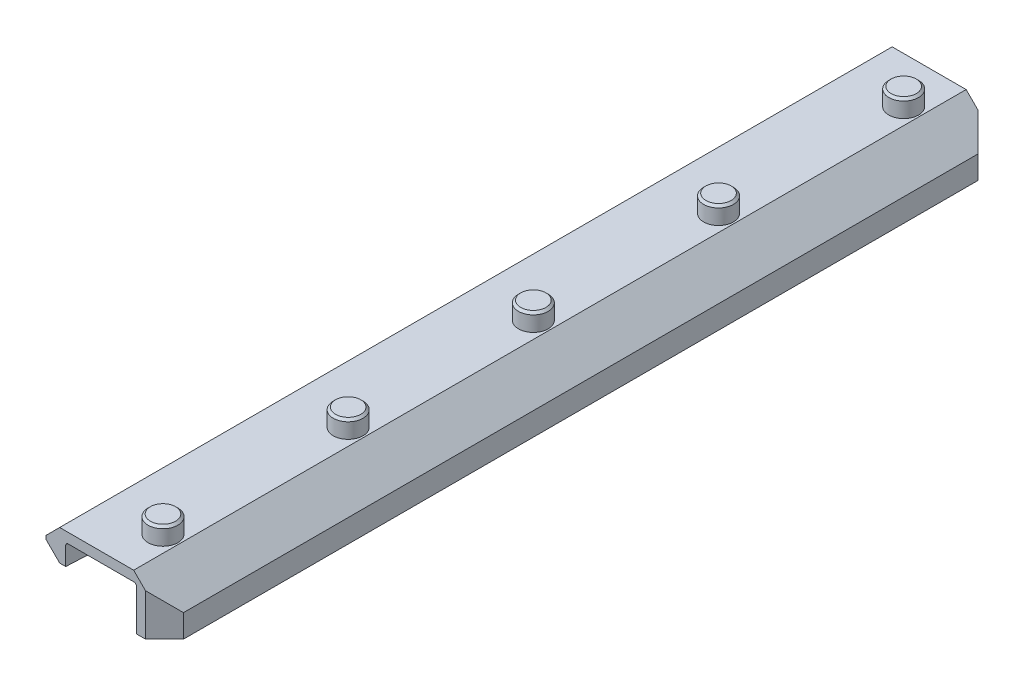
ISO-10303-21;
HEADER;
FILE_DESCRIPTION(('STEP AP214'),'2;1');
FILE_NAME('part.step','',(''),(''),'','','');
FILE_SCHEMA(('AUTOMOTIVE_DESIGN { 1 0 10303 214 1 1 1 1 }'));
ENDSEC;
DATA;
#1=APPLICATION_CONTEXT('core data for automotive mechanical design processes');
#2=APPLICATION_PROTOCOL_DEFINITION('international standard','automotive_design',2000,#1);
#3=PRODUCT_CONTEXT('',#1,'mechanical');
#4=PRODUCT('Part','Part','',(#3));
#5=PRODUCT_RELATED_PRODUCT_CATEGORY('part','',(#4));
#6=PRODUCT_DEFINITION_FORMATION('','',#4);
#7=PRODUCT_DEFINITION_CONTEXT('part definition',#1,'design');
#8=PRODUCT_DEFINITION('design','',#6,#7);
#9=PRODUCT_DEFINITION_SHAPE('','',#8);
#10=(LENGTH_UNIT() NAMED_UNIT(*) SI_UNIT(.MILLI.,.METRE.));
#11=(NAMED_UNIT(*) PLANE_ANGLE_UNIT() SI_UNIT($,.RADIAN.));
#12=(NAMED_UNIT(*) SI_UNIT($,.STERADIAN.) SOLID_ANGLE_UNIT());
#13=UNCERTAINTY_MEASURE_WITH_UNIT(LENGTH_MEASURE(1.E-05),#10,'distance_accuracy_value','');
#14=(GEOMETRIC_REPRESENTATION_CONTEXT(3) GLOBAL_UNCERTAINTY_ASSIGNED_CONTEXT((#13)) GLOBAL_UNIT_ASSIGNED_CONTEXT((#10,
#11,#12)) REPRESENTATION_CONTEXT('',''));
#15=CARTESIAN_POINT('',(0.,0.,0.));
#16=DIRECTION('',(0.,0.,1.));
#17=DIRECTION('',(1.,0.,0.));
#18=AXIS2_PLACEMENT_3D('',#15,#16,#17);
#19=CARTESIAN_POINT('',(-7.62,4.5,139.192));
#20=DIRECTION('',(0.,-1.,0.));
#21=DIRECTION('',(0.,0.,-1.));
#22=AXIS2_PLACEMENT_3D('',#19,#20,#21);
#23=PLANE('',#22);
#24=CARTESIAN_POINT('',(1.98119999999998,4.5,131.5212));
#25=DIRECTION('',(0.,-1.,0.));
#26=DIRECTION('',(0.,0.,-1.));
#27=AXIS2_PLACEMENT_3D('',#24,#25,#26);
#28=CIRCLE('',#27,2.4892);
#29=CARTESIAN_POINT('',(1.98119999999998,4.5,129.032));
#30=VERTEX_POINT('',#29);
#31=EDGE_CURVE('E260',#30,#30,#28,.F.);
#32=ORIENTED_EDGE('',*,*,#31,.F.);
#33=EDGE_LOOP('',(#32));
#34=FACE_BOUND('',#33,.T.);
#35=CARTESIAN_POINT('',(1.98119999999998,4.5,38.6334));
#36=DIRECTION('',(0.,-1.,0.));
#37=DIRECTION('',(0.,0.,-1.));
#38=AXIS2_PLACEMENT_3D('',#35,#36,#37);
#39=CIRCLE('',#38,2.4892);
#40=CARTESIAN_POINT('',(1.98119999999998,4.5,36.1442));
#41=VERTEX_POINT('',#40);
#42=EDGE_CURVE('E254',#41,#41,#39,.F.);
#43=ORIENTED_EDGE('',*,*,#42,.F.);
#44=EDGE_LOOP('',(#43));
#45=FACE_BOUND('',#44,.T.);
#46=DIRECTION('',(-1.,0.,0.));
#47=VECTOR('',#46,1.);
#48=CARTESIAN_POINT('',(-7.62,4.5,0.));
#49=LINE('',#48,#47);
#50=CARTESIAN_POINT('',(4.7498,4.5,0.));
#51=VERTEX_POINT('',#50);
#52=CARTESIAN_POINT('',(-7.62,4.5,0.));
#53=VERTEX_POINT('',#52);
#54=EDGE_CURVE('E371',#51,#53,#49,.T.);
#55=ORIENTED_EDGE('',*,*,#54,.T.);
#56=DIRECTION('',(0.,0.,-1.));
#57=VECTOR('',#56,1.);
#58=CARTESIAN_POINT('',(-7.62,4.5,139.192));
#59=LINE('',#58,#57);
#60=CARTESIAN_POINT('',(-7.62,4.5,139.192));
#61=VERTEX_POINT('',#60);
#62=EDGE_CURVE('E194',#61,#53,#59,.T.);
#63=ORIENTED_EDGE('',*,*,#62,.F.);
#64=DIRECTION('',(-1.,0.,0.));
#65=VECTOR('',#64,1.);
#66=CARTESIAN_POINT('',(-7.62,4.5,139.192));
#67=LINE('',#66,#65);
#68=CARTESIAN_POINT('',(4.7498,4.5,139.192));
#69=VERTEX_POINT('',#68);
#70=EDGE_CURVE('E181',#69,#61,#67,.T.);
#71=ORIENTED_EDGE('',*,*,#70,.F.);
#72=DIRECTION('',(0.,0.,-1.));
#73=VECTOR('',#72,1.);
#74=CARTESIAN_POINT('',(4.7498,4.5,139.192));
#75=LINE('',#74,#73);
#76=EDGE_CURVE('E192',#69,#51,#75,.T.);
#77=ORIENTED_EDGE('',*,*,#76,.T.);
#78=EDGE_LOOP('',(#55,#63,#71,#77));
#79=FACE_BOUND('',#78,.T.);
#80=CARTESIAN_POINT('',(1.98119999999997,4.5,7.67079999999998));
#81=DIRECTION('',(0.,-1.,0.));
#82=DIRECTION('',(0.,0.,-1.));
#83=AXIS2_PLACEMENT_3D('',#80,#81,#82);
#84=CIRCLE('',#83,2.4892);
#85=CARTESIAN_POINT('',(1.98119999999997,4.5,5.18159999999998));
#86=VERTEX_POINT('',#85);
#87=EDGE_CURVE('E251',#86,#86,#84,.F.);
#88=ORIENTED_EDGE('',*,*,#87,.F.);
#89=EDGE_LOOP('',(#88));
#90=FACE_BOUND('',#89,.T.);
#91=CARTESIAN_POINT('',(1.98119999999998,4.5,100.5586));
#92=DIRECTION('',(0.,-1.,0.));
#93=DIRECTION('',(0.,0.,-1.));
#94=AXIS2_PLACEMENT_3D('',#91,#92,#93);
#95=CIRCLE('',#94,2.48919999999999);
#96=CARTESIAN_POINT('',(1.98119999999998,4.5,98.0694));
#97=VERTEX_POINT('',#96);
#98=EDGE_CURVE('E257',#97,#97,#95,.F.);
#99=ORIENTED_EDGE('',*,*,#98,.F.);
#100=EDGE_LOOP('',(#99));
#101=FACE_BOUND('',#100,.T.);
#102=CARTESIAN_POINT('',(1.98119999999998,4.5,69.596));
#103=DIRECTION('',(0.,-1.,0.));
#104=DIRECTION('',(0.,0.,-1.));
#105=AXIS2_PLACEMENT_3D('',#102,#103,#104);
#106=CIRCLE('',#105,2.4892);
#107=CARTESIAN_POINT('',(1.98119999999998,4.5,67.1068));
#108=VERTEX_POINT('',#107);
#109=EDGE_CURVE('E263',#108,#108,#106,.F.);
#110=ORIENTED_EDGE('',*,*,#109,.F.);
#111=EDGE_LOOP('',(#110));
#112=FACE_BOUND('',#111,.T.);
#113=ADVANCED_FACE('F33',(#34,#45,#79,#90,#101,#112),#23,.F.);
#114=CARTESIAN_POINT('',(4.7498,4.5,139.192));
#115=DIRECTION('',(-0.707106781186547,-0.707106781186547,0.));
#116=DIRECTION('',(0.707106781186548,-0.707106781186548,0.));
#117=AXIS2_PLACEMENT_3D('',#114,#115,#116);
#118=PLANE('',#117);
#119=DIRECTION('',(0.,0.,-1.));
#120=VECTOR('',#119,1.);
#121=CARTESIAN_POINT('',(9.906,-0.656200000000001,139.192));
#122=LINE('',#121,#120);
#123=CARTESIAN_POINT('',(9.906,-0.656200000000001,136.017));
#124=VERTEX_POINT('',#123);
#125=CARTESIAN_POINT('',(9.906,-0.656199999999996,3.17499999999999));
#126=VERTEX_POINT('',#125);
#127=EDGE_CURVE('E369',#124,#126,#122,.T.);
#128=ORIENTED_EDGE('',*,*,#127,.T.);
#129=DIRECTION('',(0.577350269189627,-0.577350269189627,0.577350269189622));
#130=VECTOR('',#129,1.);
#131=CARTESIAN_POINT('',(9.906,-0.656200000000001,3.17500000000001));
#132=LINE('',#131,#130);
#133=CARTESIAN_POINT('',(6.73099999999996,2.51880000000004,0.));
#134=VERTEX_POINT('',#133);
#135=EDGE_CURVE('E242',#126,#134,#132,.F.);
#136=ORIENTED_EDGE('',*,*,#135,.T.);
#137=DIRECTION('',(-0.707106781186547,0.707106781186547,0.));
#138=VECTOR('',#137,1.);
#139=CARTESIAN_POINT('',(4.7498,4.5,0.));
#140=LINE('',#139,#138);
#141=EDGE_CURVE('E201',#134,#51,#140,.T.);
#142=ORIENTED_EDGE('',*,*,#141,.T.);
#143=ORIENTED_EDGE('',*,*,#76,.F.);
#144=DIRECTION('',(-0.707106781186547,0.707106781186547,0.));
#145=VECTOR('',#144,1.);
#146=CARTESIAN_POINT('',(4.7498,4.5,139.192));
#147=LINE('',#146,#145);
#148=CARTESIAN_POINT('',(6.73099999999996,2.51880000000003,139.192));
#149=VERTEX_POINT('',#148);
#150=EDGE_CURVE('E177',#149,#69,#147,.T.);
#151=ORIENTED_EDGE('',*,*,#150,.F.);
#152=DIRECTION('',(0.577350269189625,-0.577350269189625,-0.577350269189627));
#153=VECTOR('',#152,1.);
#154=CARTESIAN_POINT('',(4.00896666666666,5.24083333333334,141.914033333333));
#155=LINE('',#154,#153);
#156=EDGE_CURVE('E240',#149,#124,#155,.T.);
#157=ORIENTED_EDGE('',*,*,#156,.T.);
#158=EDGE_LOOP('',(#128,#136,#142,#143,#151,#157));
#159=FACE_BOUND('',#158,.T.);
#160=ADVANCED_FACE('F199',(#159),#118,.F.);
#161=CARTESIAN_POINT('',(-9.906,2.214,139.192));
#162=DIRECTION('',(0.707106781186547,-0.707106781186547,0.));
#163=DIRECTION('',(0.707106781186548,0.707106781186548,0.));
#164=AXIS2_PLACEMENT_3D('',#161,#162,#163);
#165=PLANE('',#164);
#166=DIRECTION('',(-0.707106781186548,-0.707106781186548,0.));
#167=VECTOR('',#166,1.);
#168=CARTESIAN_POINT('',(-9.906,2.214,0.));
#169=LINE('',#168,#167);
#170=CARTESIAN_POINT('',(-9.906,2.214,0.));
#171=VERTEX_POINT('',#170);
#172=EDGE_CURVE('E373',#53,#171,#169,.T.);
#173=ORIENTED_EDGE('',*,*,#172,.T.);
#174=DIRECTION('',(0.,0.,-1.));
#175=VECTOR('',#174,1.);
#176=CARTESIAN_POINT('',(-9.906,2.214,139.192));
#177=LINE('',#176,#175);
#178=CARTESIAN_POINT('',(-9.906,2.214,139.192));
#179=VERTEX_POINT('',#178);
#180=EDGE_CURVE('E208',#179,#171,#177,.T.);
#181=ORIENTED_EDGE('',*,*,#180,.F.);
#182=DIRECTION('',(-0.707106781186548,-0.707106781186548,0.));
#183=VECTOR('',#182,1.);
#184=CARTESIAN_POINT('',(-9.906,2.214,139.192));
#185=LINE('',#184,#183);
#186=EDGE_CURVE('E196',#61,#179,#185,.T.);
#187=ORIENTED_EDGE('',*,*,#186,.F.);
#188=ORIENTED_EDGE('',*,*,#62,.T.);
#189=EDGE_LOOP('',(#173,#181,#187,#188));
#190=FACE_BOUND('',#189,.T.);
#191=ADVANCED_FACE('F442',(#190),#165,.F.);
#192=CARTESIAN_POINT('',(-9.906,1.6298,139.192));
#193=DIRECTION('',(1.,0.,0.));
#194=DIRECTION('',(0.,0.,-1.));
#195=AXIS2_PLACEMENT_3D('',#192,#193,#194);
#196=PLANE('',#195);
#197=DIRECTION('',(0.,-1.,0.));
#198=VECTOR('',#197,1.);
#199=CARTESIAN_POINT('',(-9.906,1.6298,0.));
#200=LINE('',#199,#198);
#201=CARTESIAN_POINT('',(-9.906,1.6298,0.));
#202=VERTEX_POINT('',#201);
#203=EDGE_CURVE('E375',#171,#202,#200,.T.);
#204=ORIENTED_EDGE('',*,*,#203,.T.);
#205=DIRECTION('',(0.,0.,-1.));
#206=VECTOR('',#205,1.);
#207=CARTESIAN_POINT('',(-9.906,1.6298,139.192));
#208=LINE('',#207,#206);
#209=CARTESIAN_POINT('',(-9.906,1.6298,139.192));
#210=VERTEX_POINT('',#209);
#211=EDGE_CURVE('E399',#210,#202,#208,.T.);
#212=ORIENTED_EDGE('',*,*,#211,.F.);
#213=DIRECTION('',(0.,-1.,0.));
#214=VECTOR('',#213,1.);
#215=CARTESIAN_POINT('',(-9.906,1.6298,139.192));
#216=LINE('',#215,#214);
#217=EDGE_CURVE('E364',#179,#210,#216,.T.);
#218=ORIENTED_EDGE('',*,*,#217,.F.);
#219=ORIENTED_EDGE('',*,*,#180,.T.);
#220=EDGE_LOOP('',(#204,#212,#218,#219));
#221=FACE_BOUND('',#220,.T.);
#222=ADVANCED_FACE('F406',(#221),#196,.F.);
#223=CARTESIAN_POINT('',(-7.62,-0.656200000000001,139.192));
#224=DIRECTION('',(0.707106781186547,0.707106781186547,0.));
#225=DIRECTION('',(-0.707106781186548,0.707106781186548,0.));
#226=AXIS2_PLACEMENT_3D('',#223,#224,#225);
#227=PLANE('',#226);
#228=DIRECTION('',(0.707106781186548,-0.707106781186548,0.));
#229=VECTOR('',#228,1.);
#230=CARTESIAN_POINT('',(-7.62,-0.656200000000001,0.));
#231=LINE('',#230,#229);
#232=CARTESIAN_POINT('',(-7.62,-0.656200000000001,0.));
#233=VERTEX_POINT('',#232);
#234=EDGE_CURVE('E377',#202,#233,#231,.T.);
#235=ORIENTED_EDGE('',*,*,#234,.T.);
#236=DIRECTION('',(0.,0.,-1.));
#237=VECTOR('',#236,1.);
#238=CARTESIAN_POINT('',(-7.62,-0.656200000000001,139.192));
#239=LINE('',#238,#237);
#240=CARTESIAN_POINT('',(-7.62,-0.656200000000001,139.192));
#241=VERTEX_POINT('',#240);
#242=EDGE_CURVE('E397',#241,#233,#239,.T.);
#243=ORIENTED_EDGE('',*,*,#242,.F.);
#244=DIRECTION('',(0.707106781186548,-0.707106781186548,0.));
#245=VECTOR('',#244,1.);
#246=CARTESIAN_POINT('',(-7.62,-0.656200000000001,139.192));
#247=LINE('',#246,#245);
#248=EDGE_CURVE('E356',#210,#241,#247,.T.);
#249=ORIENTED_EDGE('',*,*,#248,.F.);
#250=ORIENTED_EDGE('',*,*,#211,.T.);
#251=EDGE_LOOP('',(#235,#243,#249,#250));
#252=FACE_BOUND('',#251,.T.);
#253=ADVANCED_FACE('F415',(#252),#227,.F.);
#254=CARTESIAN_POINT('',(-6.096,-0.656200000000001,139.192));
#255=DIRECTION('',(0.,1.,0.));
#256=DIRECTION('',(-1.,0.,0.));
#257=AXIS2_PLACEMENT_3D('',#254,#255,#256);
#258=PLANE('',#257);
#259=DIRECTION('',(1.,0.,0.));
#260=VECTOR('',#259,1.);
#261=CARTESIAN_POINT('',(-6.096,-0.656200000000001,0.));
#262=LINE('',#261,#260);
#263=CARTESIAN_POINT('',(-6.604,-0.656200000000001,0.));
#264=VERTEX_POINT('',#263);
#265=EDGE_CURVE('E379',#233,#264,#262,.T.);
#266=ORIENTED_EDGE('',*,*,#265,.T.);
#267=DIRECTION('',(-0.0457187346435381,0.,-0.998954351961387));
#268=VECTOR('',#267,1.);
#269=CARTESIAN_POINT('',(-6.096,-0.656200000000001,11.0998000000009));
#270=LINE('',#269,#268);
#271=CARTESIAN_POINT('',(-6.09600000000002,-0.656200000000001,11.0998));
#272=VERTEX_POINT('',#271);
#273=EDGE_CURVE('E233',#264,#272,#270,.F.);
#274=ORIENTED_EDGE('',*,*,#273,.T.);
#275=DIRECTION('',(0.,0.,-1.));
#276=VECTOR('',#275,1.);
#277=CARTESIAN_POINT('',(-6.096,-0.656200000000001,139.192));
#278=LINE('',#277,#276);
#279=CARTESIAN_POINT('',(-6.096,-0.656200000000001,128.092199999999));
#280=VERTEX_POINT('',#279);
#281=EDGE_CURVE('E394',#280,#272,#278,.T.);
#282=ORIENTED_EDGE('',*,*,#281,.F.);
#283=DIRECTION('',(-0.0457187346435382,0.,0.998954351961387));
#284=VECTOR('',#283,1.);
#285=CARTESIAN_POINT('',(-6.604,-0.656200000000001,139.192));
#286=LINE('',#285,#284);
#287=CARTESIAN_POINT('',(-6.604,-0.656200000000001,139.192));
#288=VERTEX_POINT('',#287);
#289=EDGE_CURVE('E219',#280,#288,#286,.T.);
#290=ORIENTED_EDGE('',*,*,#289,.T.);
#291=DIRECTION('',(1.,0.,0.));
#292=VECTOR('',#291,1.);
#293=CARTESIAN_POINT('',(-6.096,-0.656200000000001,139.192));
#294=LINE('',#293,#292);
#295=EDGE_CURVE('E354',#241,#288,#294,.T.);
#296=ORIENTED_EDGE('',*,*,#295,.F.);
#297=ORIENTED_EDGE('',*,*,#242,.T.);
#298=EDGE_LOOP('',(#266,#274,#282,#290,#296,#297));
#299=FACE_BOUND('',#298,.T.);
#300=ADVANCED_FACE('F416',(#299),#258,.F.);
#301=CARTESIAN_POINT('',(-6.096,2.8236,139.192));
#302=DIRECTION('',(-1.,0.,0.));
#303=DIRECTION('',(0.,-1.,0.));
#304=AXIS2_PLACEMENT_3D('',#301,#302,#303);
#305=PLANE('',#304);
#306=DIRECTION('',(0.,1.,0.));
#307=VECTOR('',#306,1.);
#308=CARTESIAN_POINT('',(-6.096,2.8236,11.0998000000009));
#309=LINE('',#308,#307);
#310=CARTESIAN_POINT('',(-6.096,2.4426,11.0998000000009));
#311=VERTEX_POINT('',#310);
#312=EDGE_CURVE('E230',#272,#311,#309,.T.);
#313=ORIENTED_EDGE('',*,*,#312,.T.);
#314=DIRECTION('',(0.,0.,-1.));
#315=VECTOR('',#314,1.);
#316=CARTESIAN_POINT('',(-6.096,2.4426,128.092199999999));
#317=LINE('',#316,#315);
#318=CARTESIAN_POINT('',(-6.096,2.4426,128.092199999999));
#319=VERTEX_POINT('',#318);
#320=EDGE_CURVE('E319',#311,#319,#317,.F.);
#321=ORIENTED_EDGE('',*,*,#320,.T.);
#322=DIRECTION('',(0.,-1.,0.));
#323=VECTOR('',#322,1.);
#324=CARTESIAN_POINT('',(-6.096,-0.656200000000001,128.092199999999));
#325=LINE('',#324,#323);
#326=EDGE_CURVE('E217',#319,#280,#325,.T.);
#327=ORIENTED_EDGE('',*,*,#326,.T.);
#328=ORIENTED_EDGE('',*,*,#281,.T.);
#329=EDGE_LOOP('',(#313,#321,#327,#328));
#330=FACE_BOUND('',#329,.T.);
#331=ADVANCED_FACE('F424',(#330),#305,.F.);
#332=CARTESIAN_POINT('',(4.699,2.8236,139.192));
#333=DIRECTION('',(0.,1.,0.));
#334=DIRECTION('',(-1.,0.,0.));
#335=AXIS2_PLACEMENT_3D('',#332,#333,#334);
#336=PLANE('',#335);
#337=DIRECTION('',(1.,0.,0.));
#338=VECTOR('',#337,1.);
#339=CARTESIAN_POINT('',(4.699,2.8236,0.));
#340=LINE('',#339,#338);
#341=CARTESIAN_POINT('',(-6.22260119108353,2.8236,0.));
#342=VERTEX_POINT('',#341);
#343=CARTESIAN_POINT('',(4.82560119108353,2.8236,0.));
#344=VERTEX_POINT('',#343);
#345=EDGE_CURVE('E382',#342,#344,#340,.T.);
#346=ORIENTED_EDGE('',*,*,#345,.T.);
#347=DIRECTION('',(0.0457187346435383,0.,-0.998954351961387));
#348=VECTOR('',#347,1.);
#349=CARTESIAN_POINT('',(-1.53169137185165,2.8236,138.906842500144));
#350=LINE('',#349,#348);
#351=CARTESIAN_POINT('',(4.318,2.8236,11.0910860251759));
#352=VERTEX_POINT('',#351);
#353=EDGE_CURVE('E307',#344,#352,#350,.F.);
#354=ORIENTED_EDGE('',*,*,#353,.T.);
#355=DIRECTION('',(0.,0.,-1.));
#356=VECTOR('',#355,1.);
#357=CARTESIAN_POINT('',(4.318,2.8236,128.092199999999));
#358=LINE('',#357,#356);
#359=CARTESIAN_POINT('',(4.318,2.8236,128.100913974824));
#360=VERTEX_POINT('',#359);
#361=EDGE_CURVE('E303',#352,#360,#358,.F.);
#362=ORIENTED_EDGE('',*,*,#361,.T.);
#363=DIRECTION('',(0.0457187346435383,0.,0.998954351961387));
#364=VECTOR('',#363,1.);
#365=CARTESIAN_POINT('',(4.82533656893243,2.8236,139.186218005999));
#366=LINE('',#365,#364);
#367=CARTESIAN_POINT('',(4.82560119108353,2.8236,139.192));
#368=VERTEX_POINT('',#367);
#369=EDGE_CURVE('E305',#360,#368,#366,.T.);
#370=ORIENTED_EDGE('',*,*,#369,.T.);
#371=DIRECTION('',(1.,0.,0.));
#372=VECTOR('',#371,1.);
#373=CARTESIAN_POINT('',(4.699,2.8236,139.192));
#374=LINE('',#373,#372);
#375=CARTESIAN_POINT('',(-6.22260119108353,2.8236,139.192));
#376=VERTEX_POINT('',#375);
#377=EDGE_CURVE('E360',#376,#368,#374,.T.);
#378=ORIENTED_EDGE('',*,*,#377,.F.);
#379=DIRECTION('',(0.0457187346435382,0.,-0.998954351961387));
#380=VECTOR('',#379,1.);
#381=CARTESIAN_POINT('',(-6.19977283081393,2.8236,138.693200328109));
#382=LINE('',#381,#380);
#383=CARTESIAN_POINT('',(-5.715,2.8236,128.100913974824));
#384=VERTEX_POINT('',#383);
#385=EDGE_CURVE('E298',#376,#384,#382,.T.);
#386=ORIENTED_EDGE('',*,*,#385,.T.);
#387=DIRECTION('',(0.,0.,-1.));
#388=VECTOR('',#387,1.);
#389=CARTESIAN_POINT('',(-5.715,2.8236,11.0998000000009));
#390=LINE('',#389,#388);
#391=CARTESIAN_POINT('',(-5.715,2.8236,11.0910860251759));
#392=VERTEX_POINT('',#391);
#393=EDGE_CURVE('E296',#384,#392,#390,.T.);
#394=ORIENTED_EDGE('',*,*,#393,.T.);
#395=DIRECTION('',(0.0457187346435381,0.,0.998954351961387));
#396=VECTOR('',#395,1.);
#397=CARTESIAN_POINT('',(0.15725510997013,2.8236,139.399860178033));
#398=LINE('',#397,#396);
#399=EDGE_CURVE('E300',#392,#342,#398,.F.);
#400=ORIENTED_EDGE('',*,*,#399,.T.);
#401=EDGE_LOOP('',(#346,#354,#362,#370,#378,#386,#394,#400));
#402=FACE_BOUND('',#401,.T.);
#403=ADVANCED_FACE('F426',(#402),#336,.F.);
#404=CARTESIAN_POINT('',(4.699,-4.5,139.192));
#405=DIRECTION('',(1.,0.,0.));
#406=DIRECTION('',(0.,1.,0.));
#407=AXIS2_PLACEMENT_3D('',#404,#405,#406);
#408=PLANE('',#407);
#409=DIRECTION('',(0.,1.,0.));
#410=VECTOR('',#409,1.);
#411=CARTESIAN_POINT('',(4.699,2.8236,128.092199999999));
#412=LINE('',#411,#410);
#413=CARTESIAN_POINT('',(4.699,-4.5,128.092199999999));
#414=VERTEX_POINT('',#413);
#415=CARTESIAN_POINT('',(4.699,2.4426,128.092199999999));
#416=VERTEX_POINT('',#415);
#417=EDGE_CURVE('E215',#414,#416,#412,.T.);
#418=ORIENTED_EDGE('',*,*,#417,.T.);
#419=DIRECTION('',(0.,0.,-1.));
#420=VECTOR('',#419,1.);
#421=CARTESIAN_POINT('',(4.699,2.4426,11.0998000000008));
#422=LINE('',#421,#420);
#423=CARTESIAN_POINT('',(4.699,2.4426,11.0998000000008));
#424=VERTEX_POINT('',#423);
#425=EDGE_CURVE('E317',#416,#424,#422,.T.);
#426=ORIENTED_EDGE('',*,*,#425,.T.);
#427=DIRECTION('',(0.,-1.,0.));
#428=VECTOR('',#427,1.);
#429=CARTESIAN_POINT('',(4.699,-4.5,11.0998000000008));
#430=LINE('',#429,#428);
#431=CARTESIAN_POINT('',(4.69899999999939,-4.5,11.0998000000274));
#432=VERTEX_POINT('',#431);
#433=EDGE_CURVE('E221',#424,#432,#430,.T.);
#434=ORIENTED_EDGE('',*,*,#433,.T.);
#435=DIRECTION('',(0.,0.,-1.));
#436=VECTOR('',#435,1.);
#437=CARTESIAN_POINT('',(4.699,-4.5,139.192));
#438=LINE('',#437,#436);
#439=EDGE_CURVE('E391',#414,#432,#438,.T.);
#440=ORIENTED_EDGE('',*,*,#439,.F.);
#441=EDGE_LOOP('',(#418,#426,#434,#440));
#442=FACE_BOUND('',#441,.T.);
#443=ADVANCED_FACE('F432',(#442),#408,.F.);
#444=CARTESIAN_POINT('',(9.906,-4.5,139.192));
#445=DIRECTION('',(0.,1.,0.));
#446=DIRECTION('',(0.,0.,1.));
#447=AXIS2_PLACEMENT_3D('',#444,#445,#446);
#448=PLANE('',#447);
#449=DIRECTION('',(1.,0.,0.));
#450=VECTOR('',#449,1.);
#451=CARTESIAN_POINT('',(9.906,-4.5,0.));
#452=LINE('',#451,#450);
#453=CARTESIAN_POINT('',(5.207,-4.5,0.));
#454=VERTEX_POINT('',#453);
#455=CARTESIAN_POINT('',(6.73099999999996,-4.5,0.));
#456=VERTEX_POINT('',#455);
#457=EDGE_CURVE('E187',#454,#456,#452,.T.);
#458=ORIENTED_EDGE('',*,*,#457,.T.);
#459=DIRECTION('',(-0.707106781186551,0.,-0.707106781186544));
#460=VECTOR('',#459,1.);
#461=CARTESIAN_POINT('',(9.906,-4.5,3.17500000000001));
#462=LINE('',#461,#460);
#463=CARTESIAN_POINT('',(9.906,-4.5,3.17500000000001));
#464=VERTEX_POINT('',#463);
#465=EDGE_CURVE('E248',#456,#464,#462,.F.);
#466=ORIENTED_EDGE('',*,*,#465,.T.);
#467=DIRECTION('',(0.,0.,-1.));
#468=VECTOR('',#467,1.);
#469=CARTESIAN_POINT('',(9.906,-4.5,139.192));
#470=LINE('',#469,#468);
#471=CARTESIAN_POINT('',(9.906,-4.5,136.017));
#472=VERTEX_POINT('',#471);
#473=EDGE_CURVE('E388',#472,#464,#470,.T.);
#474=ORIENTED_EDGE('',*,*,#473,.F.);
#475=DIRECTION('',(-0.707106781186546,0.,0.707106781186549));
#476=VECTOR('',#475,1.);
#477=CARTESIAN_POINT('',(6.73099999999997,-4.5,139.192));
#478=LINE('',#477,#476);
#479=CARTESIAN_POINT('',(6.73099999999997,-4.5,139.192));
#480=VERTEX_POINT('',#479);
#481=EDGE_CURVE('E246',#472,#480,#478,.T.);
#482=ORIENTED_EDGE('',*,*,#481,.T.);
#483=DIRECTION('',(1.,0.,0.));
#484=VECTOR('',#483,1.);
#485=CARTESIAN_POINT('',(9.906,-4.5,139.192));
#486=LINE('',#485,#484);
#487=CARTESIAN_POINT('',(5.207,-4.5,139.192));
#488=VERTEX_POINT('',#487);
#489=EDGE_CURVE('E362',#488,#480,#486,.T.);
#490=ORIENTED_EDGE('',*,*,#489,.F.);
#491=DIRECTION('',(-0.0457187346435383,0.,-0.998954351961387));
#492=VECTOR('',#491,1.);
#493=CARTESIAN_POINT('',(5.207,-4.5,139.192));
#494=LINE('',#493,#492);
#495=EDGE_CURVE('E213',#488,#414,#494,.T.);
#496=ORIENTED_EDGE('',*,*,#495,.T.);
#497=ORIENTED_EDGE('',*,*,#439,.T.);
#498=DIRECTION('',(-0.0457187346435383,0.,0.998954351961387));
#499=VECTOR('',#498,1.);
#500=CARTESIAN_POINT('',(4.699,-4.5,11.0998000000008));
#501=LINE('',#500,#499);
#502=EDGE_CURVE('E223',#432,#454,#501,.F.);
#503=ORIENTED_EDGE('',*,*,#502,.T.);
#504=EDGE_LOOP('',(#458,#466,#474,#482,#490,#496,#497,#503));
#505=FACE_BOUND('',#504,.T.);
#506=ADVANCED_FACE('F664',(#505),#448,.F.);
#507=CARTESIAN_POINT('',(9.906,-0.656200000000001,139.192));
#508=DIRECTION('',(-1.,0.,0.));
#509=DIRECTION('',(0.,0.,1.));
#510=AXIS2_PLACEMENT_3D('',#507,#508,#509);
#511=PLANE('',#510);
#512=ORIENTED_EDGE('',*,*,#473,.T.);
#513=DIRECTION('',(0.,1.,0.));
#514=VECTOR('',#513,1.);
#515=CARTESIAN_POINT('',(9.906,-0.656200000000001,3.17500000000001));
#516=LINE('',#515,#514);
#517=EDGE_CURVE('E237',#464,#126,#516,.T.);
#518=ORIENTED_EDGE('',*,*,#517,.T.);
#519=ORIENTED_EDGE('',*,*,#127,.F.);
#520=DIRECTION('',(0.,-1.,0.));
#521=VECTOR('',#520,1.);
#522=CARTESIAN_POINT('',(9.906,-4.5,136.017));
#523=LINE('',#522,#521);
#524=EDGE_CURVE('E235',#124,#472,#523,.T.);
#525=ORIENTED_EDGE('',*,*,#524,.T.);
#526=EDGE_LOOP('',(#512,#518,#519,#525));
#527=FACE_BOUND('',#526,.T.);
#528=ADVANCED_FACE('F657',(#527),#511,.F.);
#529=CARTESIAN_POINT('',(-1.4351,10.6849,139.192));
#530=DIRECTION('',(0.,0.,1.));
#531=DIRECTION('',(1.,0.,0.));
#532=AXIS2_PLACEMENT_3D('',#529,#530,#531);
#533=PLANE('',#532);
#534=ORIENTED_EDGE('',*,*,#489,.T.);
#535=DIRECTION('',(0.,1.,0.));
#536=VECTOR('',#535,1.);
#537=CARTESIAN_POINT('',(6.73099999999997,-0.656200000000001,139.192));
#538=LINE('',#537,#536);
#539=EDGE_CURVE('E184',#480,#149,#538,.T.);
#540=ORIENTED_EDGE('',*,*,#539,.T.);
#541=ORIENTED_EDGE('',*,*,#150,.T.);
#542=ORIENTED_EDGE('',*,*,#70,.T.);
#543=ORIENTED_EDGE('',*,*,#186,.T.);
#544=ORIENTED_EDGE('',*,*,#217,.T.);
#545=ORIENTED_EDGE('',*,*,#248,.T.);
#546=ORIENTED_EDGE('',*,*,#295,.T.);
#547=DIRECTION('',(0.,1.,0.));
#548=VECTOR('',#547,1.);
#549=CARTESIAN_POINT('',(-6.604,2.8236,139.192));
#550=LINE('',#549,#548);
#551=CARTESIAN_POINT('',(-6.604,2.4426,139.192));
#552=VERTEX_POINT('',#551);
#553=EDGE_CURVE('E203',#288,#552,#550,.T.);
#554=ORIENTED_EDGE('',*,*,#553,.T.);
#555=CARTESIAN_POINT('',(-6.22260119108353,2.4426,139.192));
#556=DIRECTION('',(0.,0.,1.));
#557=DIRECTION('',(1.,0.,0.));
#558=AXIS2_PLACEMENT_3D('',#555,#556,#557);
#559=ELLIPSE('',#558,0.381398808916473,0.381);
#560=EDGE_CURVE('E42',#552,#376,#559,.F.);
#561=ORIENTED_EDGE('',*,*,#560,.T.);
#562=ORIENTED_EDGE('',*,*,#377,.T.);
#563=CARTESIAN_POINT('',(4.82560119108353,2.4426,139.192));
#564=DIRECTION('',(0.,0.,1.));
#565=DIRECTION('',(1.,0.,0.));
#566=AXIS2_PLACEMENT_3D('',#563,#564,#565);
#567=ELLIPSE('',#566,0.381398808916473,0.381);
#568=CARTESIAN_POINT('',(5.207,2.4426,139.192));
#569=VERTEX_POINT('',#568);
#570=EDGE_CURVE('E11',#368,#569,#567,.F.);
#571=ORIENTED_EDGE('',*,*,#570,.T.);
#572=DIRECTION('',(0.,-1.,0.));
#573=VECTOR('',#572,1.);
#574=CARTESIAN_POINT('',(5.207,-4.5,139.192));
#575=LINE('',#574,#573);
#576=EDGE_CURVE('E206',#569,#488,#575,.T.);
#577=ORIENTED_EDGE('',*,*,#576,.T.);
#578=EDGE_LOOP('',(#534,#540,#541,#542,#543,#544,#545,#546,#554,#561,#562,#571,#577));
#579=FACE_BOUND('',#578,.T.);
#580=ADVANCED_FACE('F180',(#579),#533,.T.);
#581=CARTESIAN_POINT('',(-1.4351,10.6849,0.));
#582=DIRECTION('',(0.,0.,1.));
#583=DIRECTION('',(1.,0.,0.));
#584=AXIS2_PLACEMENT_3D('',#581,#582,#583);
#585=PLANE('',#584);
#586=ORIENTED_EDGE('',*,*,#141,.F.);
#587=DIRECTION('',(0.,-1.,0.));
#588=VECTOR('',#587,1.);
#589=CARTESIAN_POINT('',(6.73099999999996,10.6849,0.));
#590=LINE('',#589,#588);
#591=EDGE_CURVE('E244',#134,#456,#590,.T.);
#592=ORIENTED_EDGE('',*,*,#591,.T.);
#593=ORIENTED_EDGE('',*,*,#457,.F.);
#594=DIRECTION('',(0.,1.,0.));
#595=VECTOR('',#594,1.);
#596=CARTESIAN_POINT('',(5.207,10.6849,0.));
#597=LINE('',#596,#595);
#598=CARTESIAN_POINT('',(5.207,2.4426,0.));
#599=VERTEX_POINT('',#598);
#600=EDGE_CURVE('E227',#454,#599,#597,.T.);
#601=ORIENTED_EDGE('',*,*,#600,.T.);
#602=CARTESIAN_POINT('',(4.82560119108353,2.4426,0.));
#603=DIRECTION('',(0.,0.,1.));
#604=DIRECTION('',(1.,0.,0.));
#605=AXIS2_PLACEMENT_3D('',#602,#603,#604);
#606=ELLIPSE('',#605,0.381398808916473,0.381);
#607=EDGE_CURVE('E321',#599,#344,#606,.T.);
#608=ORIENTED_EDGE('',*,*,#607,.T.);
#609=ORIENTED_EDGE('',*,*,#345,.F.);
#610=CARTESIAN_POINT('',(-6.22260119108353,2.4426,0.));
#611=DIRECTION('',(0.,0.,1.));
#612=DIRECTION('',(1.,0.,0.));
#613=AXIS2_PLACEMENT_3D('',#610,#611,#612);
#614=ELLIPSE('',#613,0.381398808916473,0.381);
#615=CARTESIAN_POINT('',(-6.604,2.4426,0.));
#616=VERTEX_POINT('',#615);
#617=EDGE_CURVE('E323',#342,#616,#614,.T.);
#618=ORIENTED_EDGE('',*,*,#617,.T.);
#619=DIRECTION('',(0.,-1.,0.));
#620=VECTOR('',#619,1.);
#621=CARTESIAN_POINT('',(-6.60400000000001,10.6849,0.));
#622=LINE('',#621,#620);
#623=EDGE_CURVE('E225',#616,#264,#622,.T.);
#624=ORIENTED_EDGE('',*,*,#623,.T.);
#625=ORIENTED_EDGE('',*,*,#265,.F.);
#626=ORIENTED_EDGE('',*,*,#234,.F.);
#627=ORIENTED_EDGE('',*,*,#203,.F.);
#628=ORIENTED_EDGE('',*,*,#172,.F.);
#629=ORIENTED_EDGE('',*,*,#54,.F.);
#630=EDGE_LOOP('',(#586,#592,#593,#601,#608,#609,#618,#624,#625,#626,#627,#628,#629));
#631=FACE_BOUND('',#630,.T.);
#632=ADVANCED_FACE('F412',(#631),#585,.F.);
#633=CARTESIAN_POINT('',(5.207,10.6849,139.192));
#634=DIRECTION('',(-0.998954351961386,0.,0.0457187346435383));
#635=DIRECTION('',(0.0457187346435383,0.,0.998954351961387));
#636=AXIS2_PLACEMENT_3D('',#633,#634,#635);
#637=PLANE('',#636);
#638=ORIENTED_EDGE('',*,*,#576,.F.);
#639=DIRECTION('',(0.0457187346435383,0.,0.998954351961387));
#640=VECTOR('',#639,1.);
#641=CARTESIAN_POINT('',(5.207,2.4426,139.192));
#642=LINE('',#641,#640);
#643=EDGE_CURVE('E55',#569,#416,#642,.F.);
#644=ORIENTED_EDGE('',*,*,#643,.T.);
#645=ORIENTED_EDGE('',*,*,#417,.F.);
#646=ORIENTED_EDGE('',*,*,#495,.F.);
#647=EDGE_LOOP('',(#638,#644,#645,#646));
#648=FACE_BOUND('',#647,.T.);
#649=ADVANCED_FACE('F449',(#648),#637,.T.);
#650=CARTESIAN_POINT('',(-6.604,10.6849,139.192));
#651=DIRECTION('',(0.998954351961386,0.,0.0457187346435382));
#652=DIRECTION('',(0.0457187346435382,0.,-0.998954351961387));
#653=AXIS2_PLACEMENT_3D('',#650,#651,#652);
#654=PLANE('',#653);
#655=ORIENTED_EDGE('',*,*,#326,.F.);
#656=DIRECTION('',(0.0457187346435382,0.,-0.998954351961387));
#657=VECTOR('',#656,1.);
#658=CARTESIAN_POINT('',(-6.604,2.4426,139.192));
#659=LINE('',#658,#657);
#660=EDGE_CURVE('E314',#319,#552,#659,.F.);
#661=ORIENTED_EDGE('',*,*,#660,.T.);
#662=ORIENTED_EDGE('',*,*,#553,.F.);
#663=ORIENTED_EDGE('',*,*,#289,.F.);
#664=EDGE_LOOP('',(#655,#661,#662,#663));
#665=FACE_BOUND('',#664,.T.);
#666=ADVANCED_FACE('F349',(#665),#654,.T.);
#667=CARTESIAN_POINT('',(4.699,-4.5,11.0998000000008));
#668=DIRECTION('',(0.998954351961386,0.,0.0457187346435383));
#669=DIRECTION('',(0.0457187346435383,0.,-0.998954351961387));
#670=AXIS2_PLACEMENT_3D('',#667,#668,#669);
#671=PLANE('',#670);
#672=ORIENTED_EDGE('',*,*,#433,.F.);
#673=DIRECTION('',(-0.0457187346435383,0.,0.998954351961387));
#674=VECTOR('',#673,1.);
#675=CARTESIAN_POINT('',(4.699,2.4426,11.0998000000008));
#676=LINE('',#675,#674);
#677=EDGE_CURVE('E310',#424,#599,#676,.F.);
#678=ORIENTED_EDGE('',*,*,#677,.T.);
#679=ORIENTED_EDGE('',*,*,#600,.F.);
#680=ORIENTED_EDGE('',*,*,#502,.F.);
#681=EDGE_LOOP('',(#672,#678,#679,#680));
#682=FACE_BOUND('',#681,.T.);
#683=ADVANCED_FACE('F454',(#682),#671,.F.);
#684=CARTESIAN_POINT('',(-6.096,2.8236,11.0998000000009));
#685=DIRECTION('',(-0.998954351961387,0.,0.0457187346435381));
#686=DIRECTION('',(0.0457187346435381,0.,0.998954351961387));
#687=AXIS2_PLACEMENT_3D('',#684,#685,#686);
#688=PLANE('',#687);
#689=ORIENTED_EDGE('',*,*,#623,.F.);
#690=DIRECTION('',(-0.0457187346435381,0.,-0.998954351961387));
#691=VECTOR('',#690,1.);
#692=CARTESIAN_POINT('',(-6.096,2.4426,11.0998000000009));
#693=LINE('',#692,#691);
#694=EDGE_CURVE('E312',#616,#311,#693,.F.);
#695=ORIENTED_EDGE('',*,*,#694,.T.);
#696=ORIENTED_EDGE('',*,*,#312,.F.);
#697=ORIENTED_EDGE('',*,*,#273,.F.);
#698=EDGE_LOOP('',(#689,#695,#696,#697));
#699=FACE_BOUND('',#698,.T.);
#700=ADVANCED_FACE('F422',(#699),#688,.F.);
#701=CARTESIAN_POINT('',(9.906,-0.656200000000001,3.17500000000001));
#702=DIRECTION('',(-0.707106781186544,0.,0.707106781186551));
#703=DIRECTION('',(0.707106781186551,0.,0.707106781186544));
#704=AXIS2_PLACEMENT_3D('',#701,#702,#703);
#705=PLANE('',#704);
#706=ORIENTED_EDGE('',*,*,#465,.F.);
#707=ORIENTED_EDGE('',*,*,#591,.F.);
#708=ORIENTED_EDGE('',*,*,#135,.F.);
#709=ORIENTED_EDGE('',*,*,#517,.F.);
#710=EDGE_LOOP('',(#706,#707,#708,#709));
#711=FACE_BOUND('',#710,.T.);
#712=ADVANCED_FACE('F460',(#711),#705,.F.);
#713=CARTESIAN_POINT('',(6.73099999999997,10.6849,139.192));
#714=DIRECTION('',(0.707106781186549,0.,0.707106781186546));
#715=DIRECTION('',(0.707106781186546,0.,-0.707106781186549));
#716=AXIS2_PLACEMENT_3D('',#713,#714,#715);
#717=PLANE('',#716);
#718=ORIENTED_EDGE('',*,*,#481,.F.);
#719=ORIENTED_EDGE('',*,*,#524,.F.);
#720=ORIENTED_EDGE('',*,*,#156,.F.);
#721=ORIENTED_EDGE('',*,*,#539,.F.);
#722=EDGE_LOOP('',(#718,#719,#720,#721));
#723=FACE_BOUND('',#722,.T.);
#724=ADVANCED_FACE('F463',(#723),#717,.T.);
#725=CARTESIAN_POINT('',(1.98119999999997,7.421,7.67079999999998));
#726=DIRECTION('',(0.,-1.,0.));
#727=DIRECTION('',(0.,0.,-1.));
#728=AXIS2_PLACEMENT_3D('',#725,#726,#727);
#729=CYLINDRICAL_SURFACE('',#728,2.4892);
#730=CARTESIAN_POINT('',(1.98119999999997,7.04000000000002,7.67079999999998));
#731=DIRECTION('',(0.,1.,0.));
#732=DIRECTION('',(0.,0.,1.));
#733=AXIS2_PLACEMENT_3D('',#730,#731,#732);
#734=CIRCLE('',#733,2.4892);
#735=CARTESIAN_POINT('',(1.98119999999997,7.04000000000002,10.16));
#736=VERTEX_POINT('',#735);
#737=EDGE_CURVE('E293',#736,#736,#734,.F.);
#738=ORIENTED_EDGE('',*,*,#737,.T.);
#739=EDGE_LOOP('',(#738));
#740=FACE_BOUND('',#739,.T.);
#741=ORIENTED_EDGE('',*,*,#87,.T.);
#742=EDGE_LOOP('',(#741));
#743=FACE_BOUND('',#742,.T.);
#744=ADVANCED_FACE('F467',(#740,#743),#729,.T.);
#745=CARTESIAN_POINT('',(1.98119999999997,7.421,7.67079999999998));
#746=DIRECTION('',(0.,1.,0.));
#747=DIRECTION('',(0.,0.,1.));
#748=AXIS2_PLACEMENT_3D('',#745,#746,#747);
#749=PLANE('',#748);
#750=CARTESIAN_POINT('',(1.98119999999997,7.421,7.67079999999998));
#751=DIRECTION('',(0.,1.,0.));
#752=DIRECTION('',(0.,0.,1.));
#753=AXIS2_PLACEMENT_3D('',#750,#751,#752);
#754=CIRCLE('',#753,2.10820000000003);
#755=CARTESIAN_POINT('',(1.98119999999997,7.421,9.77900000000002));
#756=VERTEX_POINT('',#755);
#757=EDGE_CURVE('E290',#756,#756,#754,.T.);
#758=ORIENTED_EDGE('',*,*,#757,.T.);
#759=EDGE_LOOP('',(#758));
#760=FACE_BOUND('',#759,.T.);
#761=ADVANCED_FACE('F605',(#760),#749,.T.);
#762=CARTESIAN_POINT('',(1.98119999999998,7.421,38.6334));
#763=DIRECTION('',(0.,-1.,0.));
#764=DIRECTION('',(0.,0.,-1.));
#765=AXIS2_PLACEMENT_3D('',#762,#763,#764);
#766=CYLINDRICAL_SURFACE('',#765,2.4892);
#767=CARTESIAN_POINT('',(1.98119999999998,7.04000000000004,38.6334));
#768=DIRECTION('',(0.,1.,0.));
#769=DIRECTION('',(0.,0.,1.));
#770=AXIS2_PLACEMENT_3D('',#767,#768,#769);
#771=CIRCLE('',#770,2.4892);
#772=CARTESIAN_POINT('',(1.98119999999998,7.04000000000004,41.1226));
#773=VERTEX_POINT('',#772);
#774=EDGE_CURVE('E287',#773,#773,#771,.F.);
#775=ORIENTED_EDGE('',*,*,#774,.T.);
#776=EDGE_LOOP('',(#775));
#777=FACE_BOUND('',#776,.T.);
#778=ORIENTED_EDGE('',*,*,#42,.T.);
#779=EDGE_LOOP('',(#778));
#780=FACE_BOUND('',#779,.T.);
#781=ADVANCED_FACE('F597',(#777,#780),#766,.T.);
#782=CARTESIAN_POINT('',(1.98119999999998,7.421,38.6334));
#783=DIRECTION('',(0.,1.,0.));
#784=DIRECTION('',(0.,0.,1.));
#785=AXIS2_PLACEMENT_3D('',#782,#783,#784);
#786=PLANE('',#785);
#787=CARTESIAN_POINT('',(1.98119999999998,7.421,38.6334));
#788=DIRECTION('',(0.,1.,0.));
#789=DIRECTION('',(0.,0.,1.));
#790=AXIS2_PLACEMENT_3D('',#787,#788,#789);
#791=CIRCLE('',#790,2.10820000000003);
#792=CARTESIAN_POINT('',(1.98119999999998,7.421,40.7416));
#793=VERTEX_POINT('',#792);
#794=EDGE_CURVE('E284',#793,#793,#791,.T.);
#795=ORIENTED_EDGE('',*,*,#794,.T.);
#796=EDGE_LOOP('',(#795));
#797=FACE_BOUND('',#796,.T.);
#798=ADVANCED_FACE('F589',(#797),#786,.T.);
#799=CARTESIAN_POINT('',(1.98119999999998,7.421,100.5586));
#800=DIRECTION('',(0.,-1.,0.));
#801=DIRECTION('',(0.,0.,-1.));
#802=AXIS2_PLACEMENT_3D('',#799,#800,#801);
#803=CYLINDRICAL_SURFACE('',#802,2.48919999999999);
#804=CARTESIAN_POINT('',(1.98119999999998,7.04000000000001,100.5586));
#805=DIRECTION('',(0.,1.,0.));
#806=DIRECTION('',(0.,0.,1.));
#807=AXIS2_PLACEMENT_3D('',#804,#805,#806);
#808=CIRCLE('',#807,2.48919999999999);
#809=CARTESIAN_POINT('',(1.98119999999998,7.04000000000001,98.0694));
#810=VERTEX_POINT('',#809);
#811=EDGE_CURVE('E281',#810,#810,#808,.F.);
#812=ORIENTED_EDGE('',*,*,#811,.T.);
#813=EDGE_LOOP('',(#812));
#814=FACE_BOUND('',#813,.T.);
#815=ORIENTED_EDGE('',*,*,#98,.T.);
#816=EDGE_LOOP('',(#815));
#817=FACE_BOUND('',#816,.T.);
#818=ADVANCED_FACE('F581',(#814,#817),#803,.T.);
#819=CARTESIAN_POINT('',(1.98119999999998,7.421,100.5586));
#820=DIRECTION('',(0.,1.,0.));
#821=DIRECTION('',(0.,0.,1.));
#822=AXIS2_PLACEMENT_3D('',#819,#820,#821);
#823=PLANE('',#822);
#824=CARTESIAN_POINT('',(1.98119999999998,7.421,100.5586));
#825=DIRECTION('',(0.,1.,0.));
#826=DIRECTION('',(0.,0.,1.));
#827=AXIS2_PLACEMENT_3D('',#824,#825,#826);
#828=CIRCLE('',#827,2.10819999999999);
#829=CARTESIAN_POINT('',(1.98119999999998,7.421,98.4504));
#830=VERTEX_POINT('',#829);
#831=EDGE_CURVE('E278',#830,#830,#828,.T.);
#832=ORIENTED_EDGE('',*,*,#831,.T.);
#833=EDGE_LOOP('',(#832));
#834=FACE_BOUND('',#833,.T.);
#835=ADVANCED_FACE('F573',(#834),#823,.T.);
#836=CARTESIAN_POINT('',(1.98119999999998,7.421,131.5212));
#837=DIRECTION('',(0.,-1.,0.));
#838=DIRECTION('',(0.,0.,-1.));
#839=AXIS2_PLACEMENT_3D('',#836,#837,#838);
#840=CYLINDRICAL_SURFACE('',#839,2.4892);
#841=CARTESIAN_POINT('',(1.98119999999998,7.04,131.5212));
#842=DIRECTION('',(0.,1.,0.));
#843=DIRECTION('',(0.,0.,1.));
#844=AXIS2_PLACEMENT_3D('',#841,#842,#843);
#845=CIRCLE('',#844,2.4892);
#846=CARTESIAN_POINT('',(1.98119999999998,7.04,134.0104));
#847=VERTEX_POINT('',#846);
#848=EDGE_CURVE('E275',#847,#847,#845,.F.);
#849=ORIENTED_EDGE('',*,*,#848,.T.);
#850=EDGE_LOOP('',(#849));
#851=FACE_BOUND('',#850,.T.);
#852=ORIENTED_EDGE('',*,*,#31,.T.);
#853=EDGE_LOOP('',(#852));
#854=FACE_BOUND('',#853,.T.);
#855=ADVANCED_FACE('F565',(#851,#854),#840,.T.);
#856=CARTESIAN_POINT('',(1.98119999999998,7.421,131.5212));
#857=DIRECTION('',(0.,1.,0.));
#858=DIRECTION('',(0.,0.,1.));
#859=AXIS2_PLACEMENT_3D('',#856,#857,#858);
#860=PLANE('',#859);
#861=CARTESIAN_POINT('',(1.98119999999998,7.421,131.5212));
#862=DIRECTION('',(0.,1.,0.));
#863=DIRECTION('',(0.,0.,1.));
#864=AXIS2_PLACEMENT_3D('',#861,#862,#863);
#865=CIRCLE('',#864,2.10819999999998);
#866=CARTESIAN_POINT('',(1.98119999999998,7.421,133.6294));
#867=VERTEX_POINT('',#866);
#868=EDGE_CURVE('E272',#867,#867,#865,.T.);
#869=ORIENTED_EDGE('',*,*,#868,.T.);
#870=EDGE_LOOP('',(#869));
#871=FACE_BOUND('',#870,.T.);
#872=ADVANCED_FACE('F557',(#871),#860,.T.);
#873=CARTESIAN_POINT('',(1.98119999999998,7.421,69.596));
#874=DIRECTION('',(0.,-1.,0.));
#875=DIRECTION('',(0.,0.,-1.));
#876=AXIS2_PLACEMENT_3D('',#873,#874,#875);
#877=CYLINDRICAL_SURFACE('',#876,2.4892);
#878=CARTESIAN_POINT('',(1.98119999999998,7.04,69.596));
#879=DIRECTION('',(0.,1.,0.));
#880=DIRECTION('',(0.,0.,1.));
#881=AXIS2_PLACEMENT_3D('',#878,#879,#880);
#882=CIRCLE('',#881,2.4892);
#883=CARTESIAN_POINT('',(1.98119999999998,7.04,72.0852));
#884=VERTEX_POINT('',#883);
#885=EDGE_CURVE('E269',#884,#884,#882,.F.);
#886=ORIENTED_EDGE('',*,*,#885,.T.);
#887=EDGE_LOOP('',(#886));
#888=FACE_BOUND('',#887,.T.);
#889=ORIENTED_EDGE('',*,*,#109,.T.);
#890=EDGE_LOOP('',(#889));
#891=FACE_BOUND('',#890,.T.);
#892=ADVANCED_FACE('F549',(#888,#891),#877,.T.);
#893=CARTESIAN_POINT('',(1.98119999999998,7.421,69.596));
#894=DIRECTION('',(0.,1.,0.));
#895=DIRECTION('',(0.,0.,1.));
#896=AXIS2_PLACEMENT_3D('',#893,#894,#895);
#897=PLANE('',#896);
#898=CARTESIAN_POINT('',(1.98119999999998,7.421,69.596));
#899=DIRECTION('',(0.,1.,0.));
#900=DIRECTION('',(0.,0.,1.));
#901=AXIS2_PLACEMENT_3D('',#898,#899,#900);
#902=CIRCLE('',#901,2.10819999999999);
#903=CARTESIAN_POINT('',(1.98119999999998,7.421,71.7042));
#904=VERTEX_POINT('',#903);
#905=EDGE_CURVE('E266',#904,#904,#902,.T.);
#906=ORIENTED_EDGE('',*,*,#905,.T.);
#907=EDGE_LOOP('',(#906));
#908=FACE_BOUND('',#907,.T.);
#909=ADVANCED_FACE('F473',(#908),#897,.T.);
#910=CARTESIAN_POINT('',(1.98119999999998,7.421,69.596));
#911=DIRECTION('',(0.,-1.,0.));
#912=DIRECTION('',(0.,0.,-1.));
#913=AXIS2_PLACEMENT_3D('',#910,#911,#912);
#914=CONICAL_SURFACE('',#913,2.10819999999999,0.78539816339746);
#915=ORIENTED_EDGE('',*,*,#885,.F.);
#916=EDGE_LOOP('',(#915));
#917=FACE_BOUND('',#916,.T.);
#918=ORIENTED_EDGE('',*,*,#905,.F.);
#919=EDGE_LOOP('',(#918));
#920=FACE_BOUND('',#919,.T.);
#921=ADVANCED_FACE('F469',(#917,#920),#914,.T.);
#922=CARTESIAN_POINT('',(1.98119999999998,7.421,131.5212));
#923=DIRECTION('',(0.,-1.,0.));
#924=DIRECTION('',(0.,0.,-1.));
#925=AXIS2_PLACEMENT_3D('',#922,#923,#924);
#926=CONICAL_SURFACE('',#925,2.10819999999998,0.785398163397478);
#927=ORIENTED_EDGE('',*,*,#848,.F.);
#928=EDGE_LOOP('',(#927));
#929=FACE_BOUND('',#928,.T.);
#930=ORIENTED_EDGE('',*,*,#868,.F.);
#931=EDGE_LOOP('',(#930));
#932=FACE_BOUND('',#931,.T.);
#933=ADVANCED_FACE('F472',(#929,#932),#926,.T.);
#934=CARTESIAN_POINT('',(1.98119999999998,7.421,100.5586));
#935=DIRECTION('',(0.,-1.,0.));
#936=DIRECTION('',(0.,0.,-1.));
#937=AXIS2_PLACEMENT_3D('',#934,#935,#936);
#938=CONICAL_SURFACE('',#937,2.10819999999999,0.78539816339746);
#939=CARTESIAN_POINT('',(1.98119999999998,7.04000000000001,98.0694));
#940=CARTESIAN_POINT('',(1.98119999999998,7.04396875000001,98.07336875));
#941=CARTESIAN_POINT('',(1.98119999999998,7.04793750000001,98.0773375));
#942=CARTESIAN_POINT('',(1.98119999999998,7.055875,98.085275));
#943=CARTESIAN_POINT('',(1.98119999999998,7.05984375,98.08924375));
#944=CARTESIAN_POINT('',(1.98119999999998,7.06778125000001,98.09718125));
#945=CARTESIAN_POINT('',(1.98119999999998,7.07175000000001,98.10115));
#946=CARTESIAN_POINT('',(1.98119999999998,7.07968750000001,98.1090875));
#947=CARTESIAN_POINT('',(1.98119999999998,7.08365625,98.11305625));
#948=CARTESIAN_POINT('',(1.98119999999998,7.09159375,98.12099375));
#949=CARTESIAN_POINT('',(1.98119999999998,7.0955625,98.1249625));
#950=CARTESIAN_POINT('',(1.98119999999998,7.1035,98.1329));
#951=CARTESIAN_POINT('',(1.98119999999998,7.10746875,98.13686875));
#952=CARTESIAN_POINT('',(1.98119999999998,7.11540625,98.14480625));
#953=CARTESIAN_POINT('',(1.98119999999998,7.119375,98.148775));
#954=CARTESIAN_POINT('',(1.98119999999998,7.1273125,98.1567125));
#955=CARTESIAN_POINT('',(1.98119999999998,7.13128125,98.16068125));
#956=CARTESIAN_POINT('',(1.98119999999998,7.13921875,98.16861875));
#957=CARTESIAN_POINT('',(1.98119999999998,7.1431875,98.1725875));
#958=CARTESIAN_POINT('',(1.98119999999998,7.151125,98.180525));
#959=CARTESIAN_POINT('',(1.98119999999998,7.15509375,98.18449375));
#960=CARTESIAN_POINT('',(1.98119999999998,7.16303125,98.19243125));
#961=CARTESIAN_POINT('',(1.98119999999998,7.167,98.1964));
#962=CARTESIAN_POINT('',(1.98119999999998,7.1749375,98.2043375));
#963=CARTESIAN_POINT('',(1.98119999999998,7.17890625,98.20830625));
#964=CARTESIAN_POINT('',(1.98119999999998,7.18684375,98.21624375));
#965=CARTESIAN_POINT('',(1.98119999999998,7.1908125,98.2202125));
#966=CARTESIAN_POINT('',(1.98119999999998,7.19875,98.22815));
#967=CARTESIAN_POINT('',(1.98119999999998,7.20271875,98.23211875));
#968=CARTESIAN_POINT('',(1.98119999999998,7.21065625,98.24005625));
#969=CARTESIAN_POINT('',(1.98119999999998,7.214625,98.244025));
#970=CARTESIAN_POINT('',(1.98119999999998,7.2225625,98.2519625));
#971=CARTESIAN_POINT('',(1.98119999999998,7.22653125,98.25593125));
#972=CARTESIAN_POINT('',(1.98119999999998,7.23446875,98.26386875));
#973=CARTESIAN_POINT('',(1.98119999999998,7.2384375,98.2678375));
#974=CARTESIAN_POINT('',(1.98119999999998,7.246375,98.275775));
#975=CARTESIAN_POINT('',(1.98119999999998,7.25034375,98.27974375));
#976=CARTESIAN_POINT('',(1.98119999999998,7.25828125,98.28768125));
#977=CARTESIAN_POINT('',(1.98119999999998,7.26225,98.29165));
#978=CARTESIAN_POINT('',(1.98119999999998,7.2701875,98.2995875));
#979=CARTESIAN_POINT('',(1.98119999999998,7.27415625,98.30355625));
#980=CARTESIAN_POINT('',(1.98119999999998,7.28209375,98.31149375));
#981=CARTESIAN_POINT('',(1.98119999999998,7.2860625,98.3154625));
#982=CARTESIAN_POINT('',(1.98119999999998,7.294,98.3234));
#983=CARTESIAN_POINT('',(1.98119999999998,7.29796875,98.32736875));
#984=CARTESIAN_POINT('',(1.98119999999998,7.30590625,98.33530625));
#985=CARTESIAN_POINT('',(1.98119999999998,7.309875,98.339275));
#986=CARTESIAN_POINT('',(1.98119999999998,7.3178125,98.3472125));
#987=CARTESIAN_POINT('',(1.98119999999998,7.32178125,98.35118125));
#988=CARTESIAN_POINT('',(1.98119999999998,7.32971875,98.35911875));
#989=CARTESIAN_POINT('',(1.98119999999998,7.3336875,98.3630875));
#990=CARTESIAN_POINT('',(1.98119999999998,7.341625,98.371025));
#991=CARTESIAN_POINT('',(1.98119999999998,7.34559375,98.37499375));
#992=CARTESIAN_POINT('',(1.98119999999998,7.35353125,98.38293125));
#993=CARTESIAN_POINT('',(1.98119999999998,7.3575,98.3869));
#994=CARTESIAN_POINT('',(1.98119999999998,7.3654375,98.3948375));
#995=CARTESIAN_POINT('',(1.98119999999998,7.36940625,98.39880625));
#996=CARTESIAN_POINT('',(1.98119999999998,7.37734375,98.40674375));
#997=CARTESIAN_POINT('',(1.98119999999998,7.3813125,98.4107125));
#998=CARTESIAN_POINT('',(1.98119999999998,7.38925,98.41865));
#999=CARTESIAN_POINT('',(1.98119999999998,7.39321875,98.42261875));
#1000=CARTESIAN_POINT('',(1.98119999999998,7.40115625,98.43055625));
#1001=CARTESIAN_POINT('',(1.98119999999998,7.405125,98.434525));
#1002=CARTESIAN_POINT('',(1.98119999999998,7.4130625,98.4424625));
#1003=CARTESIAN_POINT('',(1.98119999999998,7.41703125,98.44643125));
#1004=CARTESIAN_POINT('',(1.98119999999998,7.421,98.4504));
#1005=B_SPLINE_CURVE_WITH_KNOTS('',3,(#939,#940,#941,#942,#943,#944,#945,#946,#947,#948,#949,
#950,#951,#952,#953,#954,#955,#956,#957,#958,#959,#960,#961,#962,#963,#964,#965,#966,#967,#968,
#969,#970,#971,#972,#973,#974,#975,#976,#977,#978,#979,#980,#981,#982,#983,#984,#985,#986,#987,
#988,#989,#990,#991,#992,#993,#994,#995,#996,#997,#998,#999,#1000,#1001,#1002,#1003,#1004),
.UNSPECIFIED.,.F.,.F.,(4,2,2,2,2,2,2,2,2,2,2,2,2,2,2,2,2,2,2,2,2,2,2,2,2,2,2,2,2,2,2,2,4),(0.,
0.0168379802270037,0.0336759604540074,0.0505139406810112,0.0673519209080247,0.0841899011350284,
0.101027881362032,0.117865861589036,0.13470384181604,0.151541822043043,0.168379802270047,
0.185217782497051,0.202055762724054,0.218893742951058,0.235731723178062,0.252569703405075,
0.26940768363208,0.286245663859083,0.303083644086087,0.319921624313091,0.336759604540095,
0.353597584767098,0.370435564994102,0.387273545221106,0.404111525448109,0.420949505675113,
0.437787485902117,0.45462546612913,0.471463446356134,0.488301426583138,0.505139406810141,
0.521977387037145,0.538815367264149),.UNSPECIFIED.);
#1006=EDGE_CURVE('BSEAM477',#810,#830,#1005,.T.);
#1007=ORIENTED_EDGE('',*,*,#811,.F.);
#1008=ORIENTED_EDGE('',*,*,#831,.F.);
#1009=ORIENTED_EDGE('',*,*,#1006,.T.);
#1010=ORIENTED_EDGE('',*,*,#1006,.F.);
#1011=EDGE_LOOP('',(#1007,#1009,#1008,#1010));
#1012=FACE_BOUND('',#1011,.T.);
#1013=ADVANCED_FACE('F477',(#1012),#938,.T.);
#1014=CARTESIAN_POINT('',(1.98119999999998,7.421,38.6334));
#1015=DIRECTION('',(0.,-1.,0.));
#1016=DIRECTION('',(0.,0.,-1.));
#1017=AXIS2_PLACEMENT_3D('',#1014,#1015,#1016);
#1018=CONICAL_SURFACE('',#1017,2.10820000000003,0.785398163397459);
#1019=ORIENTED_EDGE('',*,*,#774,.F.);
#1020=EDGE_LOOP('',(#1019));
#1021=FACE_BOUND('',#1020,.T.);
#1022=ORIENTED_EDGE('',*,*,#794,.F.);
#1023=EDGE_LOOP('',(#1022));
#1024=FACE_BOUND('',#1023,.T.);
#1025=ADVANCED_FACE('F481',(#1021,#1024),#1018,.T.);
#1026=CARTESIAN_POINT('',(1.98119999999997,7.421,7.67079999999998));
#1027=DIRECTION('',(0.,-1.,0.));
#1028=DIRECTION('',(0.,0.,-1.));
#1029=AXIS2_PLACEMENT_3D('',#1026,#1027,#1028);
#1030=CONICAL_SURFACE('',#1029,2.10820000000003,0.78539816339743);
#1031=ORIENTED_EDGE('',*,*,#737,.F.);
#1032=EDGE_LOOP('',(#1031));
#1033=FACE_BOUND('',#1032,.T.);
#1034=ORIENTED_EDGE('',*,*,#757,.F.);
#1035=EDGE_LOOP('',(#1034));
#1036=FACE_BOUND('',#1035,.T.);
#1037=ADVANCED_FACE('F485',(#1033,#1036),#1030,.T.);
#1038=CARTESIAN_POINT('',(4.82533656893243,2.4426,139.186218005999));
#1039=DIRECTION('',(0.0457187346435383,0.,0.998954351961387));
#1040=DIRECTION('',(0.998954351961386,0.,-0.0457187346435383));
#1041=AXIS2_PLACEMENT_3D('',#1038,#1039,#1040);
#1042=CYLINDRICAL_SURFACE('',#1041,0.381);
#1043=ORIENTED_EDGE('',*,*,#570,.F.);
#1044=ORIENTED_EDGE('',*,*,#369,.F.);
#1045=CARTESIAN_POINT('',(4.318,2.4426,128.100913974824));
#1046=DIRECTION('',(0.0228653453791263,0.,0.999738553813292));
#1047=DIRECTION('',(-0.999738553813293,0.,0.0228653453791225));
#1048=AXIS2_PLACEMENT_3D('',#1045,#1046,#1047);
#1049=ELLIPSE('',#1048,0.381099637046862,0.381);
#1050=EDGE_CURVE('E328',#416,#360,#1049,.T.);
#1051=ORIENTED_EDGE('',*,*,#1050,.F.);
#1052=ORIENTED_EDGE('',*,*,#643,.F.);
#1053=EDGE_LOOP('',(#1043,#1044,#1051,#1052));
#1054=FACE_BOUND('',#1053,.T.);
#1055=ADVANCED_FACE('F489',(#1054),#1042,.F.);
#1056=CARTESIAN_POINT('',(4.318,2.4426,139.192));
#1057=DIRECTION('',(0.,0.,1.));
#1058=DIRECTION('',(1.,0.,0.));
#1059=AXIS2_PLACEMENT_3D('',#1056,#1057,#1058);
#1060=CYLINDRICAL_SURFACE('',#1059,0.381);
#1061=ORIENTED_EDGE('',*,*,#1050,.T.);
#1062=ORIENTED_EDGE('',*,*,#361,.F.);
#1063=CARTESIAN_POINT('',(4.318,2.4426,11.0910860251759));
#1064=DIRECTION('',(-0.0228653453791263,0.,0.999738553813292));
#1065=DIRECTION('',(0.999738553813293,0.,0.0228653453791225));
#1066=AXIS2_PLACEMENT_3D('',#1063,#1064,#1065);
#1067=ELLIPSE('',#1066,0.381099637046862,0.381);
#1068=EDGE_CURVE('E326',#424,#352,#1067,.T.);
#1069=ORIENTED_EDGE('',*,*,#1068,.F.);
#1070=ORIENTED_EDGE('',*,*,#425,.F.);
#1071=EDGE_LOOP('',(#1061,#1062,#1069,#1070));
#1072=FACE_BOUND('',#1071,.T.);
#1073=ADVANCED_FACE('F494',(#1072),#1060,.F.);
#1074=CARTESIAN_POINT('',(-1.53169137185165,2.4426,138.906842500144));
#1075=DIRECTION('',(0.0457187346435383,0.,-0.998954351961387));
#1076=DIRECTION('',(-0.998954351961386,0.,-0.0457187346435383));
#1077=AXIS2_PLACEMENT_3D('',#1074,#1075,#1076);
#1078=CYLINDRICAL_SURFACE('',#1077,0.381);
#1079=ORIENTED_EDGE('',*,*,#607,.F.);
#1080=ORIENTED_EDGE('',*,*,#677,.F.);
#1081=ORIENTED_EDGE('',*,*,#1068,.T.);
#1082=ORIENTED_EDGE('',*,*,#353,.F.);
#1083=EDGE_LOOP('',(#1079,#1080,#1081,#1082));
#1084=FACE_BOUND('',#1083,.T.);
#1085=ADVANCED_FACE('F491',(#1084),#1078,.F.);
#1086=CARTESIAN_POINT('',(-6.19977283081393,2.4426,138.693200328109));
#1087=DIRECTION('',(0.0457187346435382,0.,-0.998954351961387));
#1088=DIRECTION('',(-0.998954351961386,0.,-0.0457187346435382));
#1089=AXIS2_PLACEMENT_3D('',#1086,#1087,#1088);
#1090=CYLINDRICAL_SURFACE('',#1089,0.381);
#1091=ORIENTED_EDGE('',*,*,#560,.F.);
#1092=ORIENTED_EDGE('',*,*,#660,.F.);
#1093=CARTESIAN_POINT('',(-5.71500000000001,2.4426,128.100913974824));
#1094=DIRECTION('',(-0.0228653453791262,0.,0.999738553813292));
#1095=DIRECTION('',(0.999738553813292,0.,0.0228653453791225));
#1096=AXIS2_PLACEMENT_3D('',#1093,#1094,#1095);
#1097=ELLIPSE('',#1096,0.381099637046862,0.381);
#1098=EDGE_CURVE('E37',#384,#319,#1097,.T.);
#1099=ORIENTED_EDGE('',*,*,#1098,.F.);
#1100=ORIENTED_EDGE('',*,*,#385,.F.);
#1101=EDGE_LOOP('',(#1091,#1092,#1099,#1100));
#1102=FACE_BOUND('',#1101,.T.);
#1103=ADVANCED_FACE('F35',(#1102),#1090,.F.);
#1104=CARTESIAN_POINT('',(-5.715,2.4426,139.192));
#1105=DIRECTION('',(0.,0.,1.));
#1106=DIRECTION('',(1.,0.,0.));
#1107=AXIS2_PLACEMENT_3D('',#1104,#1105,#1106);
#1108=CYLINDRICAL_SURFACE('',#1107,0.381);
#1109=ORIENTED_EDGE('',*,*,#1098,.T.);
#1110=ORIENTED_EDGE('',*,*,#320,.F.);
#1111=CARTESIAN_POINT('',(-5.715,2.4426,11.0910860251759));
#1112=DIRECTION('',(0.0228653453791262,0.,0.999738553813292));
#1113=DIRECTION('',(-0.999738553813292,0.,0.022865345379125));
#1114=AXIS2_PLACEMENT_3D('',#1111,#1112,#1113);
#1115=ELLIPSE('',#1114,0.381099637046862,0.381);
#1116=EDGE_CURVE('E330',#392,#311,#1115,.T.);
#1117=ORIENTED_EDGE('',*,*,#1116,.F.);
#1118=ORIENTED_EDGE('',*,*,#393,.F.);
#1119=EDGE_LOOP('',(#1109,#1110,#1117,#1118));
#1120=FACE_BOUND('',#1119,.T.);
#1121=ADVANCED_FACE('F341',(#1120),#1108,.F.);
#1122=CARTESIAN_POINT('',(0.15725510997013,2.4426,139.399860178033));
#1123=DIRECTION('',(0.0457187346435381,0.,0.998954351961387));
#1124=DIRECTION('',(0.998954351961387,0.,-0.0457187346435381));
#1125=AXIS2_PLACEMENT_3D('',#1122,#1123,#1124);
#1126=CYLINDRICAL_SURFACE('',#1125,0.381);
#1127=ORIENTED_EDGE('',*,*,#1116,.T.);
#1128=ORIENTED_EDGE('',*,*,#694,.F.);
#1129=ORIENTED_EDGE('',*,*,#617,.F.);
#1130=ORIENTED_EDGE('',*,*,#399,.F.);
#1131=EDGE_LOOP('',(#1127,#1128,#1129,#1130));
#1132=FACE_BOUND('',#1131,.T.);
#1133=ADVANCED_FACE('F502',(#1132),#1126,.F.);
#1134=CLOSED_SHELL('',(#113,#160,#191,#222,#253,#300,#331,#403,#443,#506,#528,#580,#632,#649,
#666,#683,#700,#712,#724,#744,#761,#781,#798,#818,#835,#855,#872,#892,#909,#921,#933,#1013,
#1025,#1037,#1055,#1073,#1085,#1103,#1121,#1133));
#1135=MANIFOLD_SOLID_BREP('B2',#1134);
#1136=ADVANCED_BREP_SHAPE_REPRESENTATION('',(#18,#1135),#14);
#1137=SHAPE_DEFINITION_REPRESENTATION(#9,#1136);
ENDSEC;
END-ISO-10303-21;
